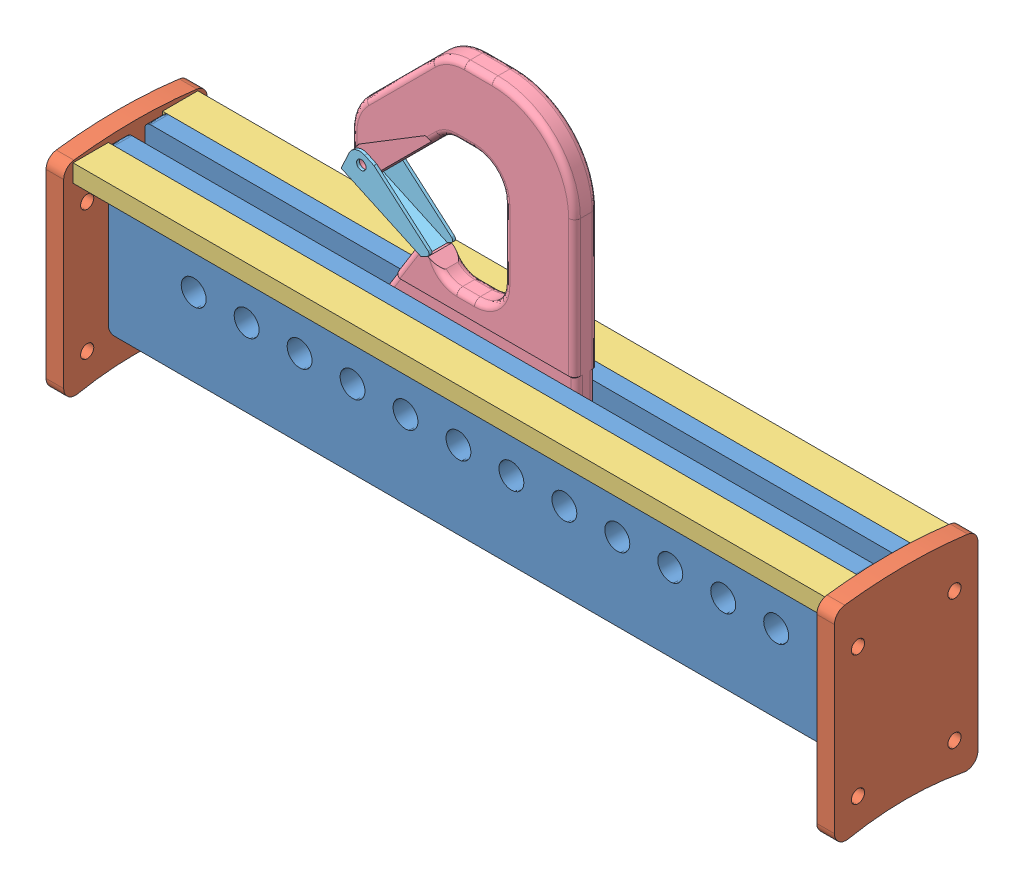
SolidWorks assembly Ti Lifting Beam Assembly 2.SLDASM, configuration Default (file format 12000). Lengths in mm.
Overall size (425.45 233.76 77.47).
10 component instances, 6 part files, 25 mates.
Components (placement in the parent):
- Ti Lifting Beam2-2: Ti Lifting Beam2.SLDPRT [Default] at (-3.175 0 0) size (406.4 88.9 9.53)
- Ti Lifting Beam2-3: Ti Lifting Beam2.SLDPRT [Default] at (-3.175 0 19.685) size (406.4 88.9 9.53)
- Lifting Beam Ti End Plate-1: Lifting Beam Ti End Plate.SLDPRT [Default] at (-12.7 -34.6656 53.34) x (0 0 -1) z (1 0 0) size (77.47 112.48 9.53)
- Lifting Beam Ti End Plate-2: Lifting Beam Ti End Plate.SLDPRT [Default] at (403.225 -34.6656 53.34) x (0 0 -1) z (1 0 0) size (77.47 112.48 9.53)
- Ti Lifting Beam Tee2-1: Ti Lifting Beam Tee2.SLDPRT [Default] at (-3.175 88.9 -19.05) x (1 0 0) z (0 -1 0) size (409.58 19.05 9.53)
- Ti Lifting Beam Tee2-2: Ti Lifting Beam Tee2.SLDPRT [Default] at (-3.175 79.375 48.26) x (1 0 0) z (0 1 0) size (409.58 19.05 9.53)
- Ti. Lifting Eye-1: Ti. Lifting Eye.SLDPRT [Default] at (214.3125 162.56 9.8425) (suppressed, hidden)
- Mapper_Recovery_Hook_3-1: Mapper_Recovery_Hook_3.SLDASM [Default] at (188.0046 71.0223 71.9267) x (-1 0 0) z (0 0 -1) size (125.16 203.2 14.22)
  - Mapper_Recovery_Hook_2-1: Mapper_Recovery_Hook_2.SLDPRT [FEA] at (-51.7079 -35.4623 51.3781) size (120.65 203.2 13.89)
  - Mapper_Recovery_Hook_Gate-1: Mapper_Recovery_Hook_Gate.SLDPRT [Default] at (73.4501 60.7918 50.6161) x (0 0 1) z (-0.908436 -0.418023 0) size (14.22 16.51 50.15)
Mates (geometry in assembly coordinates):
- Coincident3: coincident: point of Ti Lifting Beam2-2
- Parallel2: parallel aligned: plane of Ti Lifting Beam2-2 through (-3.175 88.9 9.525) normal (0 1 0); plane of Ti Lifting Beam2-3 through (-3.175 88.9 29.21) normal (0 1 0)
- Coincident6: coincident aligned: plane of Ti Lifting Beam2-2 through (-3.175 0 9.525) normal (-1 0 0); plane of Ti Lifting Beam2-3 through (-3.175 0 29.21) normal (-1 0 0)
- Coincident7: coincident aligned: plane of Ti Lifting Beam2-2 through (-3.175 88.9 9.525) normal (0 1 0); plane of Ti Lifting Beam2-3 through (-3.175 88.9 29.21) normal (0 1 0)
- Distance1: distance = 10.16 mm anti-aligned: plane of Ti Lifting Beam2-2 through (-3.175 0 9.525) normal (0 0 1); plane of Ti Lifting Beam2-3 through (-3.175 0 19.685) normal (0 0 -1)
- Coincident9: coincident anti-aligned: plane of Ti Lifting Beam2-3 through (-3.175 0 29.21) normal (0 0 1); plane of Ti Lifting Beam Tee2-2 through (-3.175 88.9 29.21) normal (0 0 -1)
- Coincident10: coincident anti-aligned: line of Ti Lifting Beam2-3 through (400.05 88.9 29.21) axis (-1 0 0); line of Ti Lifting Beam Tee2-2 through (-3.175 88.9 29.21) axis (1 0 0)
- Coincident11: coincident aligned: plane of Ti Lifting Beam2-3 through (-3.175 0 29.21) normal (-1 0 0); plane of Ti Lifting Beam Tee2-2 through (-3.175 88.9 48.26) normal (-1 0 0)
- Coincident12: coincident anti-aligned: plane of Ti Lifting Beam2-2 through (-3.175 0 0) normal (0 0 -1); plane of Ti Lifting Beam Tee2-1 through (-3.175 79.375 0) normal (0 0 1)
- Coincident13: coincident anti-aligned: plane of Ti Lifting Beam2-2 through (-3.175 0 0) normal (0 0 -1); plane of Ti Lifting Beam Tee2-1 through (-3.175 79.375 0) normal (0 0 1)
- Coincident14: coincident aligned: plane of Ti Lifting Beam2-2 through (-3.175 88.9 9.525) normal (0 1 0); plane of Ti Lifting Beam Tee2-1 through (-3.175 88.9 -19.05) normal (0 1 0)
- Coincident15: coincident aligned: plane of Ti Lifting Beam2-2 through (-3.175 0 9.525) normal (-1 0 0); plane of Ti Lifting Beam Tee2-1 through (-3.175 79.375 -19.05) normal (-1 0 0)
- Coincident16: coincident anti-aligned: plane of Ti Lifting Beam2-3 through (-3.175 0 29.21) normal (-1 0 0); plane of Lifting Beam Ti End Plate-1 through (-3.175 105.0344 53.34) normal (1 0 0)
- Coincident17: coincident anti-aligned: plane of Ti Lifting Beam2-2 through (403.225 0 9.525) normal (1 0 0); plane of Lifting Beam Ti End Plate-2 through (403.225 105.0344 53.34) normal (-1 0 0)
- Coincident18: coincident aligned: plane of Lifting Beam Ti End Plate-1 through (-3.175 -34.6656 -24.13) normal (0 0 -1); plane of Lifting Beam Ti End Plate-2 through (412.75 -34.6656 -24.13) normal (0 0 -1)
- Concentric1: concentric aligned: cylinder of Lifting Beam Ti End Plate-1 through (-3.175 -166.6875 14.605) axis (-1 0 0) radius 258.7625; cylinder of Lifting Beam Ti End Plate-2 through (412.75 -166.6875 14.605) axis (-1 0 0) radius 258.7625
- Coincident19: coincident anti-aligned: plane of Ti Lifting Beam2-2 through (403.225 0 9.525) normal (1 0 0); plane of Lifting Beam Ti End Plate-2 through (403.225 105.0344 53.34) normal (-1 0 0)
- Distance2: distance = 3.175 mm: moEndPointRef_w of Lifting Beam Ti End Plate-1; line of Ti Lifting Beam Tee2-2 through (-3.175 88.9 48.26) axis (0 0 -1)
- Distance3: distance = 5.08 mm aligned: plane of Ti Lifting Beam Tee2-2 through (-3.175 88.9 48.26) normal (0 0 1); plane of Lifting Beam Ti End Plate-2 through (412.75 -34.6656 53.34) normal (0 0 1)
- Concentric2: concentric aligned: circle of Ti Lifting Beam2-2; circle of Ti. Lifting Eye-1
- Concentric3: concentric aligned: circle of Ti Lifting Beam2-3; circle of Ti. Lifting Eye-1
- Distance4: distance = 0.3175 mm anti-aligned: plane of Ti Lifting Beam2-3 through (-3.175 0 19.685) normal (0 0 -1); plane of Ti. Lifting Eye-1 through (176.2125 22.86 19.3675) normal (0 0 1)
- Concentric6: concentric aligned: circle of Ti Lifting Beam2-3; circle of Mapper_Recovery_Hook_3-1/Mapper_Recovery_Hook_2-1
- Concentric7: concentric aligned: circle of Ti Lifting Beam2-3; circle of Mapper_Recovery_Hook_3-1/Mapper_Recovery_Hook_2-1
- Distance6: distance = 0.3175 mm anti-aligned: plane of Mapper_Recovery_Hook_3-1/Mapper_Recovery_Hook_2-1 through (131.7625 92.71 19.3675) normal (0 0 1); plane of Ti Lifting Beam2-3 through (-3.175 0 19.685) normal (0 0 -1)
